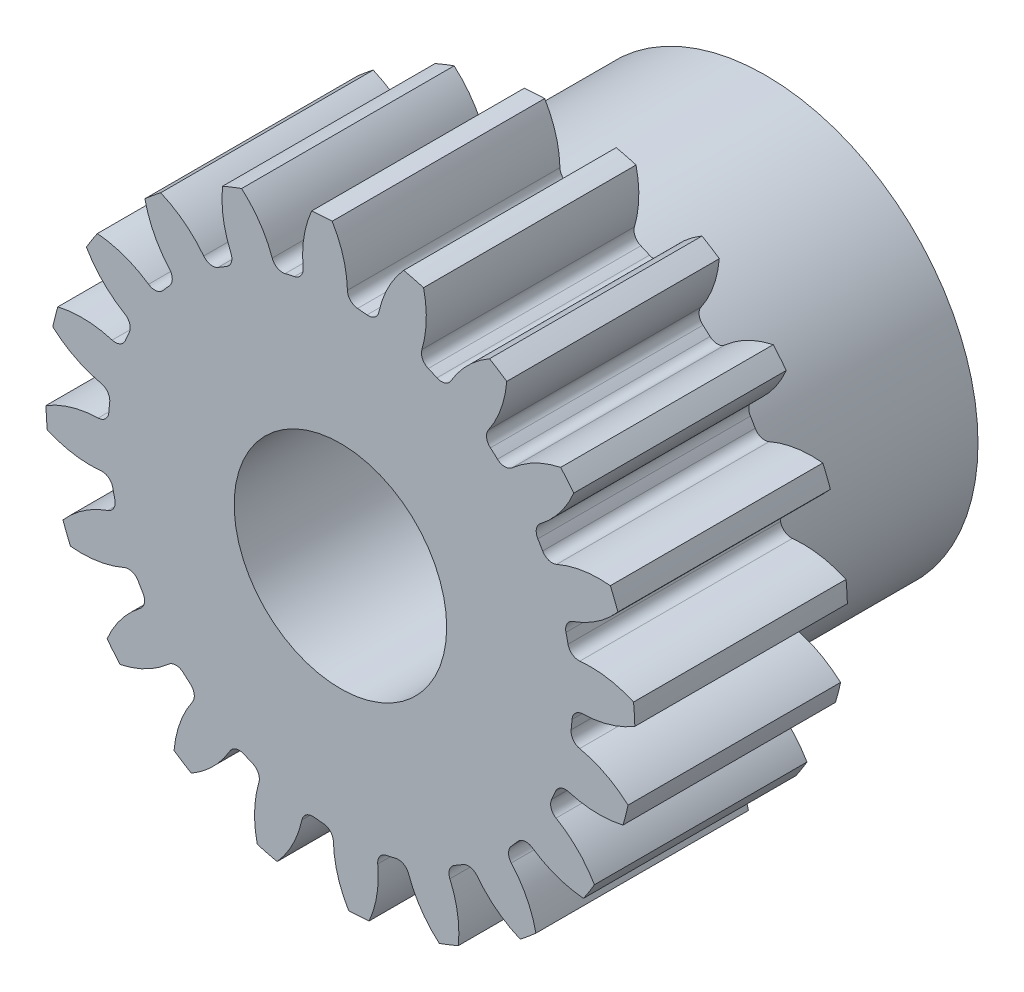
from build123d import *

# Parameters (mm, degrees)
SKETCH3_R         = 4.4
GEARBODY_DEPTH    = 3.175
TOOTHCUT_DEPTH    = 7.985744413
CIRPATTERN1_COUNT = 20
HUB1DIA_R         = 3.175
HUB1_DEPTH        = 3.175
BOREDIA_R         = 1.5875
BORE_DEPTH        = 12700


with BuildPart() as part:
    # Sketch3 → gearBody (new body)
    with BuildSketch(Plane.XY):
        Circle(SKETCH3_R)
    extrude(amount=GEARBODY_DEPTH)

    # Sketch2 → toothCut (cut, through all)
    with BuildSketch(Plane.XY):
        with BuildLine():
            ThreePointArc((3.446434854, -0.396781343), (3.453801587, -0.326501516), (3.45973532, -0.256086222))
            ThreePointArc((3.45973532, -0.256086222), (3.510009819, -0.149760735), (3.618632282, -0.104663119))
            ThreePointArc((3.618632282, -0.104663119), (4.337297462, 0.088324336), (4.889018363, 0.58765173))
            ThreePointArc((4.889018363, 0.58765173), (4.902352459, -0.463438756), (4.692287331, -1.493410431))
            ThreePointArc((4.692287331, -1.493410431), (4.243910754, -0.899539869), (3.574141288, -0.575298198))
            ThreePointArc((3.574141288, -0.575298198), (3.475894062, -0.510644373), (3.446434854, -0.396781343))
        make_face()
    toothcut = extrude(amount=TOOTHCUT_DEPTH, mode=Mode.SUBTRACT)

    # CirPattern1: toothCut ×20 about axis
    cirpattern1_axis = Axis((0, 0, 0), (0, 0, 1))
    for i in range(1, CIRPATTERN1_COUNT):
        add(toothcut.rotate(cirpattern1_axis, i * 360 / CIRPATTERN1_COUNT), mode=Mode.SUBTRACT)

    # hub1Dia → hub1 (add)
    with BuildSketch(Plane(origin=(0, 0, 0), x_dir=(-1, 0, 0), z_dir=(0, 0, -1))):
        with Locations(Location((0, 0, 0), (0, 0, 180))):
            Circle(HUB1DIA_R)
    extrude(amount=HUB1_DEPTH)

    # boreDia → bore (cut, symmetric)
    with BuildSketch(Plane.XY):
        Circle(BOREDIA_R)
    extrude(amount=BORE_DEPTH, both=True, mode=Mode.SUBTRACT)


solid = part.part
